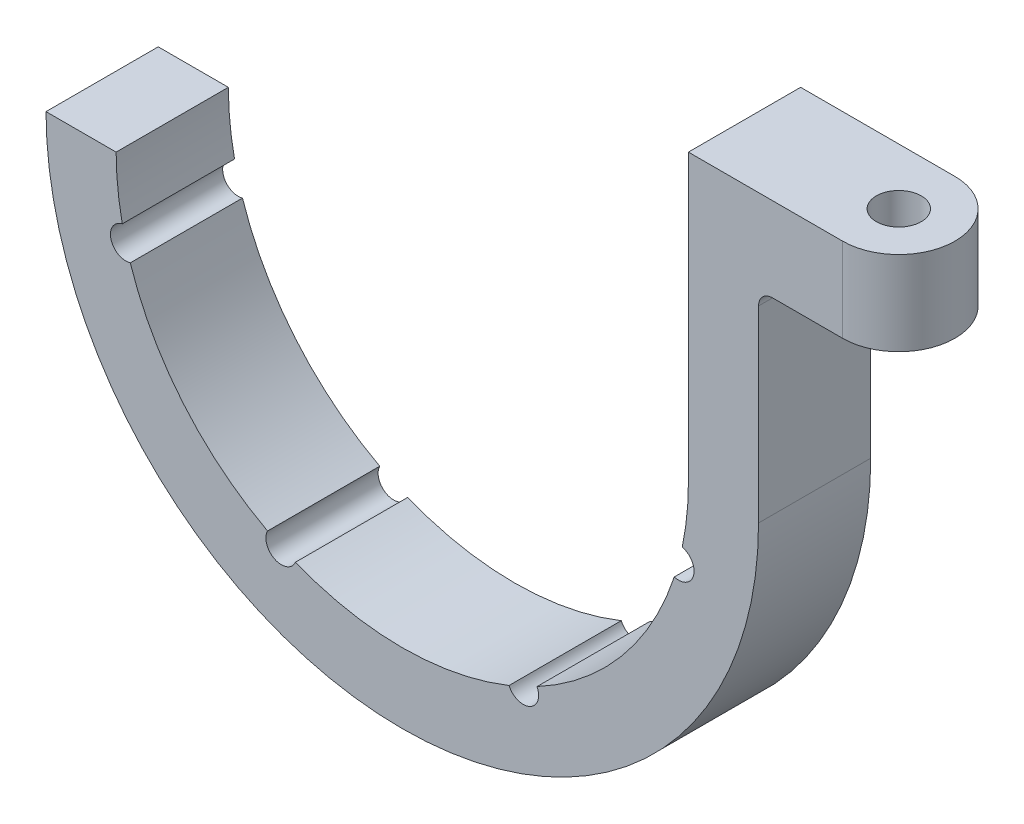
ISO-10303-21;
HEADER;
FILE_DESCRIPTION(('STEP AP214'),'2;1');
FILE_NAME('part.step','',(''),(''),'','','');
FILE_SCHEMA(('AUTOMOTIVE_DESIGN { 1 0 10303 214 1 1 1 1 }'));
ENDSEC;
DATA;
#1=APPLICATION_CONTEXT('core data for automotive mechanical design processes');
#2=APPLICATION_PROTOCOL_DEFINITION('international standard','automotive_design',2000,#1);
#3=PRODUCT_CONTEXT('',#1,'mechanical');
#4=PRODUCT('Part','Part','',(#3));
#5=PRODUCT_RELATED_PRODUCT_CATEGORY('part','',(#4));
#6=PRODUCT_DEFINITION_FORMATION('','',#4);
#7=PRODUCT_DEFINITION_CONTEXT('part definition',#1,'design');
#8=PRODUCT_DEFINITION('design','',#6,#7);
#9=PRODUCT_DEFINITION_SHAPE('','',#8);
#10=(LENGTH_UNIT() NAMED_UNIT(*) SI_UNIT(.MILLI.,.METRE.));
#11=(NAMED_UNIT(*) PLANE_ANGLE_UNIT() SI_UNIT($,.RADIAN.));
#12=(NAMED_UNIT(*) SI_UNIT($,.STERADIAN.) SOLID_ANGLE_UNIT());
#13=UNCERTAINTY_MEASURE_WITH_UNIT(LENGTH_MEASURE(1.E-05),#10,'distance_accuracy_value','');
#14=(GEOMETRIC_REPRESENTATION_CONTEXT(3) GLOBAL_UNCERTAINTY_ASSIGNED_CONTEXT((#13)) GLOBAL_UNIT_ASSIGNED_CONTEXT((#10,
#11,#12)) REPRESENTATION_CONTEXT('',''));
#15=CARTESIAN_POINT('',(0.,0.,0.));
#16=DIRECTION('',(0.,0.,1.));
#17=DIRECTION('',(1.,0.,0.));
#18=AXIS2_PLACEMENT_3D('',#15,#16,#17);
#19=CARTESIAN_POINT('',(0.,0.,8.));
#20=DIRECTION('',(0.,0.,-1.));
#21=DIRECTION('',(-1.,0.,0.));
#22=AXIS2_PLACEMENT_3D('',#19,#20,#21);
#23=CYLINDRICAL_SURFACE('',#22,20.4);
#24=CARTESIAN_POINT('',(0.,0.,0.));
#25=DIRECTION('',(0.,0.,1.));
#26=DIRECTION('',(1.,0.,0.));
#27=AXIS2_PLACEMENT_3D('',#24,#25,#26);
#28=CIRCLE('',#27,20.4);
#29=CARTESIAN_POINT('',(19.9608379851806,-4.21010058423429,0.));
#30=VERTEX_POINT('',#29);
#31=CARTESIAN_POINT('',(20.4,0.,0.));
#32=VERTEX_POINT('',#31);
#33=EDGE_CURVE('E196',#30,#32,#28,.T.);
#34=ORIENTED_EDGE('',*,*,#33,.F.);
#35=DIRECTION('',(0.,0.,-1.));
#36=VECTOR('',#35,1.);
#37=CARTESIAN_POINT('',(19.9608379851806,-4.21010058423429,8.));
#38=LINE('',#37,#36);
#39=CARTESIAN_POINT('',(19.9608379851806,-4.21010058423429,8.));
#40=VERTEX_POINT('',#39);
#41=EDGE_CURVE('E314',#40,#30,#38,.T.);
#42=ORIENTED_EDGE('',*,*,#41,.F.);
#43=CARTESIAN_POINT('',(0.,0.,8.));
#44=DIRECTION('',(0.,0.,1.));
#45=DIRECTION('',(1.,0.,0.));
#46=AXIS2_PLACEMENT_3D('',#43,#44,#45);
#47=CIRCLE('',#46,20.4);
#48=CARTESIAN_POINT('',(20.4,0.,8.));
#49=VERTEX_POINT('',#48);
#50=EDGE_CURVE('E198',#40,#49,#47,.T.);
#51=ORIENTED_EDGE('',*,*,#50,.T.);
#52=DIRECTION('',(0.,0.,-1.));
#53=VECTOR('',#52,1.);
#54=CARTESIAN_POINT('',(20.4,0.,8.));
#55=LINE('',#54,#53);
#56=EDGE_CURVE('E237',#49,#32,#55,.T.);
#57=ORIENTED_EDGE('',*,*,#56,.T.);
#58=EDGE_LOOP('',(#34,#42,#51,#57));
#59=FACE_BOUND('',#58,.T.);
#60=ADVANCED_FACE('F47',(#59),#23,.F.);
#61=CARTESIAN_POINT('',(19.704886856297,-5.27990852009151,8.));
#62=DIRECTION('',(0.,0.,-1.));
#63=DIRECTION('',(-1.,0.,0.));
#64=AXIS2_PLACEMENT_3D('',#61,#62,#63);
#65=CYLINDRICAL_SURFACE('',#64,1.1);
#66=CARTESIAN_POINT('',(19.704886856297,-5.27990852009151,0.));
#67=DIRECTION('',(0.,0.,1.));
#68=DIRECTION('',(1.,0.,0.));
#69=AXIS2_PLACEMENT_3D('',#66,#67,#68);
#70=CIRCLE('',#69,1.1);
#71=CARTESIAN_POINT('',(19.3916430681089,-6.3343649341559,0.));
#72=VERTEX_POINT('',#71);
#73=EDGE_CURVE('E241',#30,#72,#70,.F.);
#74=ORIENTED_EDGE('',*,*,#73,.T.);
#75=DIRECTION('',(0.,0.,-1.));
#76=VECTOR('',#75,1.);
#77=CARTESIAN_POINT('',(19.3916430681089,-6.3343649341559,8.));
#78=LINE('',#77,#76);
#79=CARTESIAN_POINT('',(19.3916430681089,-6.3343649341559,8.));
#80=VERTEX_POINT('',#79);
#81=EDGE_CURVE('E311',#80,#72,#78,.T.);
#82=ORIENTED_EDGE('',*,*,#81,.F.);
#83=CARTESIAN_POINT('',(19.704886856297,-5.27990852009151,8.));
#84=DIRECTION('',(0.,0.,1.));
#85=DIRECTION('',(1.,0.,0.));
#86=AXIS2_PLACEMENT_3D('',#83,#84,#85);
#87=CIRCLE('',#86,1.1);
#88=EDGE_CURVE('E202',#40,#80,#87,.F.);
#89=ORIENTED_EDGE('',*,*,#88,.F.);
#90=ORIENTED_EDGE('',*,*,#41,.T.);
#91=EDGE_LOOP('',(#74,#82,#89,#90));
#92=FACE_BOUND('',#91,.T.);
#93=ADVANCED_FACE('F352',(#92),#65,.F.);
#94=CARTESIAN_POINT('',(9.60545517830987,-17.9970895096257,0.));
#95=VERTEX_POINT('',#94);
#96=EDGE_CURVE('E243',#95,#72,#28,.T.);
#97=ORIENTED_EDGE('',*,*,#96,.F.);
#98=DIRECTION('',(0.,0.,-1.));
#99=VECTOR('',#98,1.);
#100=CARTESIAN_POINT('',(9.60545517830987,-17.9970895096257,8.));
#101=LINE('',#100,#99);
#102=CARTESIAN_POINT('',(9.60545517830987,-17.9970895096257,8.));
#103=VERTEX_POINT('',#102);
#104=EDGE_CURVE('E308',#103,#95,#101,.T.);
#105=ORIENTED_EDGE('',*,*,#104,.F.);
#106=EDGE_CURVE('E205',#103,#80,#47,.T.);
#107=ORIENTED_EDGE('',*,*,#106,.T.);
#108=ORIENTED_EDGE('',*,*,#81,.T.);
#109=EDGE_LOOP('',(#97,#105,#107,#108));
#110=FACE_BOUND('',#109,.T.);
#111=ADVANCED_FACE('F346',(#110),#23,.F.);
#112=CARTESIAN_POINT('',(8.62141253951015,-18.4886788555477,8.));
#113=DIRECTION('',(0.,0.,-1.));
#114=DIRECTION('',(-1.,0.,0.));
#115=AXIS2_PLACEMENT_3D('',#112,#113,#114);
#116=CYLINDRICAL_SURFACE('',#115,1.1);
#117=CARTESIAN_POINT('',(8.62141253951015,-18.4886788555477,0.));
#118=DIRECTION('',(0.,0.,1.));
#119=DIRECTION('',(1.,0.,0.));
#120=AXIS2_PLACEMENT_3D('',#117,#118,#119);
#121=CIRCLE('',#120,1.1);
#122=CARTESIAN_POINT('',(7.6123028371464,-18.9265117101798,0.));
#123=VERTEX_POINT('',#122);
#124=EDGE_CURVE('E247',#95,#123,#121,.F.);
#125=ORIENTED_EDGE('',*,*,#124,.T.);
#126=DIRECTION('',(0.,0.,-1.));
#127=VECTOR('',#126,1.);
#128=CARTESIAN_POINT('',(7.6123028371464,-18.9265117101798,8.));
#129=LINE('',#128,#127);
#130=CARTESIAN_POINT('',(7.6123028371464,-18.9265117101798,8.));
#131=VERTEX_POINT('',#130);
#132=EDGE_CURVE('E305',#131,#123,#129,.T.);
#133=ORIENTED_EDGE('',*,*,#132,.F.);
#134=CARTESIAN_POINT('',(8.62141253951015,-18.4886788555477,8.));
#135=DIRECTION('',(0.,0.,1.));
#136=DIRECTION('',(1.,0.,0.));
#137=AXIS2_PLACEMENT_3D('',#134,#135,#136);
#138=CIRCLE('',#137,1.1);
#139=EDGE_CURVE('E208',#103,#131,#138,.F.);
#140=ORIENTED_EDGE('',*,*,#139,.F.);
#141=ORIENTED_EDGE('',*,*,#104,.T.);
#142=EDGE_LOOP('',(#125,#133,#140,#141));
#143=FACE_BOUND('',#142,.T.);
#144=ADVANCED_FACE('F400',(#143),#116,.F.);
#145=CARTESIAN_POINT('',(-7.6123028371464,-18.9265117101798,0.));
#146=VERTEX_POINT('',#145);
#147=EDGE_CURVE('E251',#146,#123,#28,.T.);
#148=ORIENTED_EDGE('',*,*,#147,.F.);
#149=DIRECTION('',(0.,0.,-1.));
#150=VECTOR('',#149,1.);
#151=CARTESIAN_POINT('',(-7.6123028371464,-18.9265117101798,8.));
#152=LINE('',#151,#150);
#153=CARTESIAN_POINT('',(-7.6123028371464,-18.9265117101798,8.));
#154=VERTEX_POINT('',#153);
#155=EDGE_CURVE('E302',#154,#146,#152,.T.);
#156=ORIENTED_EDGE('',*,*,#155,.F.);
#157=EDGE_CURVE('E211',#154,#131,#47,.T.);
#158=ORIENTED_EDGE('',*,*,#157,.T.);
#159=ORIENTED_EDGE('',*,*,#132,.T.);
#160=EDGE_LOOP('',(#148,#156,#158,#159));
#161=FACE_BOUND('',#160,.T.);
#162=ADVANCED_FACE('F397',(#161),#23,.F.);
#163=CARTESIAN_POINT('',(-8.62141253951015,-18.4886788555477,8.));
#164=DIRECTION('',(0.,0.,-1.));
#165=DIRECTION('',(-1.,0.,0.));
#166=AXIS2_PLACEMENT_3D('',#163,#164,#165);
#167=CYLINDRICAL_SURFACE('',#166,1.1);
#168=CARTESIAN_POINT('',(-8.62141253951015,-18.4886788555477,0.));
#169=DIRECTION('',(0.,0.,1.));
#170=DIRECTION('',(1.,0.,0.));
#171=AXIS2_PLACEMENT_3D('',#168,#169,#170);
#172=CIRCLE('',#171,1.1);
#173=CARTESIAN_POINT('',(-9.60545517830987,-17.9970895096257,0.));
#174=VERTEX_POINT('',#173);
#175=EDGE_CURVE('E252',#174,#146,#172,.T.);
#176=ORIENTED_EDGE('',*,*,#175,.F.);
#177=DIRECTION('',(0.,0.,-1.));
#178=VECTOR('',#177,1.);
#179=CARTESIAN_POINT('',(-9.60545517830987,-17.9970895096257,8.));
#180=LINE('',#179,#178);
#181=CARTESIAN_POINT('',(-9.60545517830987,-17.9970895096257,8.));
#182=VERTEX_POINT('',#181);
#183=EDGE_CURVE('E299',#182,#174,#180,.T.);
#184=ORIENTED_EDGE('',*,*,#183,.F.);
#185=CARTESIAN_POINT('',(-8.62141253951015,-18.4886788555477,8.));
#186=DIRECTION('',(0.,0.,1.));
#187=DIRECTION('',(1.,0.,0.));
#188=AXIS2_PLACEMENT_3D('',#185,#186,#187);
#189=CIRCLE('',#188,1.1);
#190=EDGE_CURVE('E212',#182,#154,#189,.T.);
#191=ORIENTED_EDGE('',*,*,#190,.T.);
#192=ORIENTED_EDGE('',*,*,#155,.T.);
#193=EDGE_LOOP('',(#176,#184,#191,#192));
#194=FACE_BOUND('',#193,.T.);
#195=ADVANCED_FACE('F393',(#194),#167,.F.);
#196=CARTESIAN_POINT('',(-19.3916430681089,-6.3343649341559,0.));
#197=VERTEX_POINT('',#196);
#198=EDGE_CURVE('E256',#197,#174,#28,.T.);
#199=ORIENTED_EDGE('',*,*,#198,.F.);
#200=DIRECTION('',(0.,0.,-1.));
#201=VECTOR('',#200,1.);
#202=CARTESIAN_POINT('',(-19.3916430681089,-6.3343649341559,8.));
#203=LINE('',#202,#201);
#204=CARTESIAN_POINT('',(-19.3916430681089,-6.3343649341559,8.));
#205=VERTEX_POINT('',#204);
#206=EDGE_CURVE('E296',#205,#197,#203,.T.);
#207=ORIENTED_EDGE('',*,*,#206,.F.);
#208=EDGE_CURVE('E216',#205,#182,#47,.T.);
#209=ORIENTED_EDGE('',*,*,#208,.T.);
#210=ORIENTED_EDGE('',*,*,#183,.T.);
#211=EDGE_LOOP('',(#199,#207,#209,#210));
#212=FACE_BOUND('',#211,.T.);
#213=ADVANCED_FACE('F389',(#212),#23,.F.);
#214=CARTESIAN_POINT('',(-19.704886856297,-5.27990852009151,8.));
#215=DIRECTION('',(0.,0.,-1.));
#216=DIRECTION('',(-1.,0.,0.));
#217=AXIS2_PLACEMENT_3D('',#214,#215,#216);
#218=CYLINDRICAL_SURFACE('',#217,1.1);
#219=CARTESIAN_POINT('',(-19.704886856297,-5.27990852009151,0.));
#220=DIRECTION('',(0.,0.,1.));
#221=DIRECTION('',(1.,0.,0.));
#222=AXIS2_PLACEMENT_3D('',#219,#220,#221);
#223=CIRCLE('',#222,1.1);
#224=CARTESIAN_POINT('',(-19.9608379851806,-4.21010058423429,0.));
#225=VERTEX_POINT('',#224);
#226=EDGE_CURVE('E257',#225,#197,#223,.T.);
#227=ORIENTED_EDGE('',*,*,#226,.F.);
#228=DIRECTION('',(0.,0.,-1.));
#229=VECTOR('',#228,1.);
#230=CARTESIAN_POINT('',(-19.9608379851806,-4.21010058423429,8.));
#231=LINE('',#230,#229);
#232=CARTESIAN_POINT('',(-19.9608379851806,-4.21010058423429,8.));
#233=VERTEX_POINT('',#232);
#234=EDGE_CURVE('E293',#233,#225,#231,.T.);
#235=ORIENTED_EDGE('',*,*,#234,.F.);
#236=CARTESIAN_POINT('',(-19.704886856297,-5.27990852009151,8.));
#237=DIRECTION('',(0.,0.,1.));
#238=DIRECTION('',(1.,0.,0.));
#239=AXIS2_PLACEMENT_3D('',#236,#237,#238);
#240=CIRCLE('',#239,1.1);
#241=EDGE_CURVE('E217',#233,#205,#240,.T.);
#242=ORIENTED_EDGE('',*,*,#241,.T.);
#243=ORIENTED_EDGE('',*,*,#206,.T.);
#244=EDGE_LOOP('',(#227,#235,#242,#243));
#245=FACE_BOUND('',#244,.T.);
#246=ADVANCED_FACE('F385',(#245),#218,.F.);
#247=CARTESIAN_POINT('',(-20.4,0.,0.));
#248=VERTEX_POINT('',#247);
#249=EDGE_CURVE('E242',#248,#225,#28,.T.);
#250=ORIENTED_EDGE('',*,*,#249,.F.);
#251=DIRECTION('',(0.,0.,-1.));
#252=VECTOR('',#251,1.);
#253=CARTESIAN_POINT('',(-20.4,0.,8.));
#254=LINE('',#253,#252);
#255=CARTESIAN_POINT('',(-20.4,0.,8.));
#256=VERTEX_POINT('',#255);
#257=EDGE_CURVE('E290',#256,#248,#254,.T.);
#258=ORIENTED_EDGE('',*,*,#257,.F.);
#259=EDGE_CURVE('E204',#256,#233,#47,.T.);
#260=ORIENTED_EDGE('',*,*,#259,.T.);
#261=ORIENTED_EDGE('',*,*,#234,.T.);
#262=EDGE_LOOP('',(#250,#258,#260,#261));
#263=FACE_BOUND('',#262,.T.);
#264=ADVANCED_FACE('F381',(#263),#23,.F.);
#265=CARTESIAN_POINT('',(0.,0.,8.));
#266=DIRECTION('',(0.,-1.,0.));
#267=DIRECTION('',(0.,0.,-1.));
#268=AXIS2_PLACEMENT_3D('',#265,#266,#267);
#269=PLANE('',#268);
#270=DIRECTION('',(-1.,0.,0.));
#271=VECTOR('',#270,1.);
#272=CARTESIAN_POINT('',(0.,0.,0.));
#273=LINE('',#272,#271);
#274=CARTESIAN_POINT('',(-25.4,0.,0.));
#275=VERTEX_POINT('',#274);
#276=EDGE_CURVE('E261',#248,#275,#273,.T.);
#277=ORIENTED_EDGE('',*,*,#276,.T.);
#278=DIRECTION('',(0.,0.,-1.));
#279=VECTOR('',#278,1.);
#280=CARTESIAN_POINT('',(-25.4,0.,8.));
#281=LINE('',#280,#279);
#282=CARTESIAN_POINT('',(-25.4,0.,8.));
#283=VERTEX_POINT('',#282);
#284=EDGE_CURVE('E286',#283,#275,#281,.T.);
#285=ORIENTED_EDGE('',*,*,#284,.F.);
#286=DIRECTION('',(-1.,0.,0.));
#287=VECTOR('',#286,1.);
#288=CARTESIAN_POINT('',(0.,0.,8.));
#289=LINE('',#288,#287);
#290=EDGE_CURVE('E221',#256,#283,#289,.T.);
#291=ORIENTED_EDGE('',*,*,#290,.F.);
#292=ORIENTED_EDGE('',*,*,#257,.T.);
#293=EDGE_LOOP('',(#277,#285,#291,#292));
#294=FACE_BOUND('',#293,.T.);
#295=ADVANCED_FACE('F416',(#294),#269,.F.);
#296=CARTESIAN_POINT('',(0.,0.,8.));
#297=DIRECTION('',(0.,0.,-1.));
#298=DIRECTION('',(-1.,0.,0.));
#299=AXIS2_PLACEMENT_3D('',#296,#297,#298);
#300=CYLINDRICAL_SURFACE('',#299,25.4);
#301=CARTESIAN_POINT('',(0.,0.,0.));
#302=DIRECTION('',(0.,0.,1.));
#303=DIRECTION('',(1.,0.,0.));
#304=AXIS2_PLACEMENT_3D('',#301,#302,#303);
#305=CIRCLE('',#304,25.4);
#306=CARTESIAN_POINT('',(25.4,0.,0.));
#307=VERTEX_POINT('',#306);
#308=EDGE_CURVE('E264',#275,#307,#305,.T.);
#309=ORIENTED_EDGE('',*,*,#308,.T.);
#310=DIRECTION('',(0.,0.,-1.));
#311=VECTOR('',#310,1.);
#312=CARTESIAN_POINT('',(25.4,0.,8.));
#313=LINE('',#312,#311);
#314=CARTESIAN_POINT('',(25.4,0.,8.));
#315=VERTEX_POINT('',#314);
#316=EDGE_CURVE('E282',#315,#307,#313,.T.);
#317=ORIENTED_EDGE('',*,*,#316,.F.);
#318=CARTESIAN_POINT('',(0.,0.,8.));
#319=DIRECTION('',(0.,0.,1.));
#320=DIRECTION('',(1.,0.,0.));
#321=AXIS2_PLACEMENT_3D('',#318,#319,#320);
#322=CIRCLE('',#321,25.4);
#323=EDGE_CURVE('E224',#283,#315,#322,.T.);
#324=ORIENTED_EDGE('',*,*,#323,.F.);
#325=ORIENTED_EDGE('',*,*,#284,.T.);
#326=EDGE_LOOP('',(#309,#317,#324,#325));
#327=FACE_BOUND('',#326,.T.);
#328=ADVANCED_FACE('F375',(#327),#300,.T.);
#329=CARTESIAN_POINT('',(25.4,0.,8.));
#330=DIRECTION('',(-1.,0.,0.));
#331=DIRECTION('',(0.,0.,1.));
#332=AXIS2_PLACEMENT_3D('',#329,#330,#331);
#333=PLANE('',#332);
#334=DIRECTION('',(0.,1.,0.));
#335=VECTOR('',#334,1.);
#336=CARTESIAN_POINT('',(25.4,0.,0.));
#337=LINE('',#336,#335);
#338=CARTESIAN_POINT('',(25.4,13.4,0.));
#339=VERTEX_POINT('',#338);
#340=EDGE_CURVE('E267',#307,#339,#337,.T.);
#341=ORIENTED_EDGE('',*,*,#340,.T.);
#342=DIRECTION('',(0.,0.,1.));
#343=VECTOR('',#342,1.);
#344=CARTESIAN_POINT('',(25.4,13.4,8.));
#345=LINE('',#344,#343);
#346=CARTESIAN_POINT('',(25.4,13.4,8.));
#347=VERTEX_POINT('',#346);
#348=EDGE_CURVE('E317',#339,#347,#345,.T.);
#349=ORIENTED_EDGE('',*,*,#348,.T.);
#350=DIRECTION('',(0.,1.,0.));
#351=VECTOR('',#350,1.);
#352=CARTESIAN_POINT('',(25.4,0.,8.));
#353=LINE('',#352,#351);
#354=EDGE_CURVE('E227',#315,#347,#353,.T.);
#355=ORIENTED_EDGE('',*,*,#354,.F.);
#356=ORIENTED_EDGE('',*,*,#316,.T.);
#357=EDGE_LOOP('',(#341,#349,#355,#356));
#358=FACE_BOUND('',#357,.T.);
#359=ADVANCED_FACE('F368',(#358),#333,.F.);
#360=CARTESIAN_POINT('',(0.,20.4,8.));
#361=DIRECTION('',(0.,1.,0.));
#362=DIRECTION('',(0.,0.,1.));
#363=AXIS2_PLACEMENT_3D('',#360,#361,#362);
#364=PLANE('',#363);
#365=DIRECTION('',(1.,0.,0.));
#366=VECTOR('',#365,1.);
#367=CARTESIAN_POINT('',(0.,20.4,0.));
#368=LINE('',#367,#366);
#369=CARTESIAN_POINT('',(20.4,20.4,0.));
#370=VERTEX_POINT('',#369);
#371=CARTESIAN_POINT('',(31.4,20.4,0.));
#372=VERTEX_POINT('',#371);
#373=EDGE_CURVE('E271',#370,#372,#368,.T.);
#374=ORIENTED_EDGE('',*,*,#373,.F.);
#375=DIRECTION('',(0.,0.,-1.));
#376=VECTOR('',#375,1.);
#377=CARTESIAN_POINT('',(20.4,20.4,8.));
#378=LINE('',#377,#376);
#379=CARTESIAN_POINT('',(20.4,20.4,8.));
#380=VERTEX_POINT('',#379);
#381=EDGE_CURVE('E279',#380,#370,#378,.T.);
#382=ORIENTED_EDGE('',*,*,#381,.F.);
#383=DIRECTION('',(1.,0.,0.));
#384=VECTOR('',#383,1.);
#385=CARTESIAN_POINT('',(0.,20.4,8.));
#386=LINE('',#385,#384);
#387=CARTESIAN_POINT('',(31.4,20.4,8.));
#388=VERTEX_POINT('',#387);
#389=EDGE_CURVE('E230',#380,#388,#386,.T.);
#390=ORIENTED_EDGE('',*,*,#389,.T.);
#391=CARTESIAN_POINT('',(31.4,20.4,4.));
#392=DIRECTION('',(0.,1.,0.));
#393=DIRECTION('',(0.,0.,-1.));
#394=AXIS2_PLACEMENT_3D('',#391,#392,#393);
#395=CIRCLE('',#394,4.);
#396=EDGE_CURVE('E174',#388,#372,#395,.T.);
#397=ORIENTED_EDGE('',*,*,#396,.T.);
#398=EDGE_LOOP('',(#374,#382,#390,#397));
#399=FACE_BOUND('',#398,.T.);
#400=CARTESIAN_POINT('',(31.4,20.4,4.));
#401=DIRECTION('',(0.,1.,0.));
#402=DIRECTION('',(0.,0.,1.));
#403=AXIS2_PLACEMENT_3D('',#400,#401,#402);
#404=CIRCLE('',#403,1.60000000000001);
#405=CARTESIAN_POINT('',(31.4,20.4,5.6));
#406=VERTEX_POINT('',#405);
#407=EDGE_CURVE('E578',#406,#406,#404,.T.);
#408=ORIENTED_EDGE('',*,*,#407,.F.);
#409=EDGE_LOOP('',(#408));
#410=FACE_BOUND('',#409,.T.);
#411=ADVANCED_FACE('F360',(#399,#410),#364,.T.);
#412=CARTESIAN_POINT('',(20.4,0.,8.));
#413=DIRECTION('',(-1.,0.,0.));
#414=DIRECTION('',(0.,-1.,0.));
#415=AXIS2_PLACEMENT_3D('',#412,#413,#414);
#416=PLANE('',#415);
#417=DIRECTION('',(0.,1.,0.));
#418=VECTOR('',#417,1.);
#419=CARTESIAN_POINT('',(20.4,0.,0.));
#420=LINE('',#419,#418);
#421=EDGE_CURVE('E203',#32,#370,#420,.T.);
#422=ORIENTED_EDGE('',*,*,#421,.F.);
#423=ORIENTED_EDGE('',*,*,#56,.F.);
#424=DIRECTION('',(0.,1.,0.));
#425=VECTOR('',#424,1.);
#426=CARTESIAN_POINT('',(20.4,0.,8.));
#427=LINE('',#426,#425);
#428=EDGE_CURVE('E233',#49,#380,#427,.T.);
#429=ORIENTED_EDGE('',*,*,#428,.T.);
#430=ORIENTED_EDGE('',*,*,#381,.T.);
#431=EDGE_LOOP('',(#422,#423,#429,#430));
#432=FACE_BOUND('',#431,.T.);
#433=ADVANCED_FACE('F357',(#432),#416,.T.);
#434=CARTESIAN_POINT('',(0.,0.,8.));
#435=DIRECTION('',(0.,0.,1.));
#436=DIRECTION('',(1.,0.,0.));
#437=AXIS2_PLACEMENT_3D('',#434,#435,#436);
#438=PLANE('',#437);
#439=ORIENTED_EDGE('',*,*,#50,.F.);
#440=ORIENTED_EDGE('',*,*,#88,.T.);
#441=ORIENTED_EDGE('',*,*,#106,.F.);
#442=ORIENTED_EDGE('',*,*,#139,.T.);
#443=ORIENTED_EDGE('',*,*,#157,.F.);
#444=ORIENTED_EDGE('',*,*,#190,.F.);
#445=ORIENTED_EDGE('',*,*,#208,.F.);
#446=ORIENTED_EDGE('',*,*,#241,.F.);
#447=ORIENTED_EDGE('',*,*,#259,.F.);
#448=ORIENTED_EDGE('',*,*,#290,.T.);
#449=ORIENTED_EDGE('',*,*,#323,.T.);
#450=ORIENTED_EDGE('',*,*,#354,.T.);
#451=CARTESIAN_POINT('',(26.4,13.4,8.));
#452=DIRECTION('',(0.,0.,1.));
#453=DIRECTION('',(1.,0.,0.));
#454=AXIS2_PLACEMENT_3D('',#451,#452,#453);
#455=CIRCLE('',#454,1.);
#456=CARTESIAN_POINT('',(26.4,14.4,8.));
#457=VERTEX_POINT('',#456);
#458=EDGE_CURVE('E56',#347,#457,#455,.F.);
#459=ORIENTED_EDGE('',*,*,#458,.T.);
#460=DIRECTION('',(1.,0.,0.));
#461=VECTOR('',#460,1.);
#462=CARTESIAN_POINT('',(31.4,14.4,8.));
#463=LINE('',#462,#461);
#464=CARTESIAN_POINT('',(31.4,14.4,8.));
#465=VERTEX_POINT('',#464);
#466=EDGE_CURVE('E164',#457,#465,#463,.T.);
#467=ORIENTED_EDGE('',*,*,#466,.T.);
#468=DIRECTION('',(0.,1.,0.));
#469=VECTOR('',#468,1.);
#470=CARTESIAN_POINT('',(31.4,14.4,8.));
#471=LINE('',#470,#469);
#472=EDGE_CURVE('E169',#465,#388,#471,.T.);
#473=ORIENTED_EDGE('',*,*,#472,.T.);
#474=ORIENTED_EDGE('',*,*,#389,.F.);
#475=ORIENTED_EDGE('',*,*,#428,.F.);
#476=EDGE_LOOP('',(#439,#440,#441,#442,#443,#444,#445,#446,#447,#448,#449,#450,#459,#467,#473,
#474,#475));
#477=FACE_BOUND('',#476,.T.);
#478=ADVANCED_FACE('F167',(#477),#438,.T.);
#479=CARTESIAN_POINT('',(0.,0.,0.));
#480=DIRECTION('',(0.,0.,1.));
#481=DIRECTION('',(1.,0.,0.));
#482=AXIS2_PLACEMENT_3D('',#479,#480,#481);
#483=PLANE('',#482);
#484=ORIENTED_EDGE('',*,*,#33,.T.);
#485=ORIENTED_EDGE('',*,*,#421,.T.);
#486=ORIENTED_EDGE('',*,*,#373,.T.);
#487=DIRECTION('',(0.,1.,0.));
#488=VECTOR('',#487,1.);
#489=CARTESIAN_POINT('',(31.4,14.4,0.));
#490=LINE('',#489,#488);
#491=CARTESIAN_POINT('',(31.4,14.4,0.));
#492=VERTEX_POINT('',#491);
#493=EDGE_CURVE('E182',#492,#372,#490,.T.);
#494=ORIENTED_EDGE('',*,*,#493,.F.);
#495=DIRECTION('',(-1.,0.,0.));
#496=VECTOR('',#495,1.);
#497=CARTESIAN_POINT('',(25.4,14.4,0.));
#498=LINE('',#497,#496);
#499=CARTESIAN_POINT('',(26.4,14.4,0.));
#500=VERTEX_POINT('',#499);
#501=EDGE_CURVE('E183',#492,#500,#498,.T.);
#502=ORIENTED_EDGE('',*,*,#501,.T.);
#503=CARTESIAN_POINT('',(26.4,13.4,0.));
#504=DIRECTION('',(0.,0.,1.));
#505=DIRECTION('',(1.,0.,0.));
#506=AXIS2_PLACEMENT_3D('',#503,#504,#505);
#507=CIRCLE('',#506,1.);
#508=EDGE_CURVE('E11',#500,#339,#507,.T.);
#509=ORIENTED_EDGE('',*,*,#508,.T.);
#510=ORIENTED_EDGE('',*,*,#340,.F.);
#511=ORIENTED_EDGE('',*,*,#308,.F.);
#512=ORIENTED_EDGE('',*,*,#276,.F.);
#513=ORIENTED_EDGE('',*,*,#249,.T.);
#514=ORIENTED_EDGE('',*,*,#226,.T.);
#515=ORIENTED_EDGE('',*,*,#198,.T.);
#516=ORIENTED_EDGE('',*,*,#175,.T.);
#517=ORIENTED_EDGE('',*,*,#147,.T.);
#518=ORIENTED_EDGE('',*,*,#124,.F.);
#519=ORIENTED_EDGE('',*,*,#96,.T.);
#520=ORIENTED_EDGE('',*,*,#73,.F.);
#521=EDGE_LOOP('',(#484,#485,#486,#494,#502,#509,#510,#511,#512,#513,#514,#515,#516,#517,#518,
#519,#520));
#522=FACE_BOUND('',#521,.T.);
#523=ADVANCED_FACE('F343',(#522),#483,.F.);
#524=CARTESIAN_POINT('',(31.4,14.4,4.));
#525=DIRECTION('',(0.,1.,0.));
#526=DIRECTION('',(0.,0.,1.));
#527=AXIS2_PLACEMENT_3D('',#524,#525,#526);
#528=CYLINDRICAL_SURFACE('',#527,4.);
#529=ORIENTED_EDGE('',*,*,#396,.F.);
#530=ORIENTED_EDGE('',*,*,#472,.F.);
#531=CARTESIAN_POINT('',(31.4,14.4,4.));
#532=DIRECTION('',(0.,1.,0.));
#533=DIRECTION('',(0.,0.,-1.));
#534=AXIS2_PLACEMENT_3D('',#531,#532,#533);
#535=CIRCLE('',#534,4.);
#536=EDGE_CURVE('E173',#465,#492,#535,.T.);
#537=ORIENTED_EDGE('',*,*,#536,.T.);
#538=ORIENTED_EDGE('',*,*,#493,.T.);
#539=EDGE_LOOP('',(#529,#530,#537,#538));
#540=FACE_BOUND('',#539,.T.);
#541=ADVANCED_FACE('F178',(#540),#528,.T.);
#542=CARTESIAN_POINT('',(31.4,14.4,4.));
#543=DIRECTION('',(0.,-1.,0.));
#544=DIRECTION('',(0.,0.,-1.));
#545=AXIS2_PLACEMENT_3D('',#542,#543,#544);
#546=PLANE('',#545);
#547=CARTESIAN_POINT('',(31.4,14.4,4.));
#548=DIRECTION('',(0.,1.,0.));
#549=DIRECTION('',(0.,0.,1.));
#550=AXIS2_PLACEMENT_3D('',#547,#548,#549);
#551=CIRCLE('',#550,1.60000000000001);
#552=CARTESIAN_POINT('',(31.4,14.4,5.6));
#553=VERTEX_POINT('',#552);
#554=EDGE_CURVE('E194',#553,#553,#551,.T.);
#555=ORIENTED_EDGE('',*,*,#554,.T.);
#556=EDGE_LOOP('',(#555));
#557=FACE_BOUND('',#556,.T.);
#558=ORIENTED_EDGE('',*,*,#466,.F.);
#559=DIRECTION('',(0.,0.,1.));
#560=VECTOR('',#559,1.);
#561=CARTESIAN_POINT('',(26.4,14.4,4.));
#562=LINE('',#561,#560);
#563=EDGE_CURVE('E63',#457,#500,#562,.F.);
#564=ORIENTED_EDGE('',*,*,#563,.T.);
#565=ORIENTED_EDGE('',*,*,#501,.F.);
#566=ORIENTED_EDGE('',*,*,#536,.F.);
#567=EDGE_LOOP('',(#558,#564,#565,#566));
#568=FACE_BOUND('',#567,.T.);
#569=ADVANCED_FACE('F185',(#557,#568),#546,.T.);
#570=CARTESIAN_POINT('',(31.4,14.4,4.));
#571=DIRECTION('',(0.,1.,0.));
#572=DIRECTION('',(0.,0.,1.));
#573=AXIS2_PLACEMENT_3D('',#570,#571,#572);
#574=CYLINDRICAL_SURFACE('',#573,1.60000000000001);
#575=ORIENTED_EDGE('',*,*,#554,.F.);
#576=EDGE_LOOP('',(#575));
#577=FACE_BOUND('',#576,.T.);
#578=ORIENTED_EDGE('',*,*,#407,.T.);
#579=EDGE_LOOP('',(#578));
#580=FACE_BOUND('',#579,.T.);
#581=ADVANCED_FACE('F533',(#577,#580),#574,.F.);
#582=CARTESIAN_POINT('',(26.4,13.4,8.));
#583=DIRECTION('',(0.,0.,1.));
#584=DIRECTION('',(1.,0.,0.));
#585=AXIS2_PLACEMENT_3D('',#582,#583,#584);
#586=CYLINDRICAL_SURFACE('',#585,1.);
#587=ORIENTED_EDGE('',*,*,#508,.F.);
#588=ORIENTED_EDGE('',*,*,#563,.F.);
#589=ORIENTED_EDGE('',*,*,#458,.F.);
#590=ORIENTED_EDGE('',*,*,#348,.F.);
#591=EDGE_LOOP('',(#587,#588,#589,#590));
#592=FACE_BOUND('',#591,.T.);
#593=ADVANCED_FACE('F49',(#592),#586,.F.);
#594=CLOSED_SHELL('',(#60,#93,#111,#144,#162,#195,#213,#246,#264,#295,#328,#359,#411,#433,#478,
#523,#541,#569,#581,#593));
#595=MANIFOLD_SOLID_BREP('B2',#594);
#596=ADVANCED_BREP_SHAPE_REPRESENTATION('',(#18,#595),#14);
#597=SHAPE_DEFINITION_REPRESENTATION(#9,#596);
ENDSEC;
END-ISO-10303-21;
